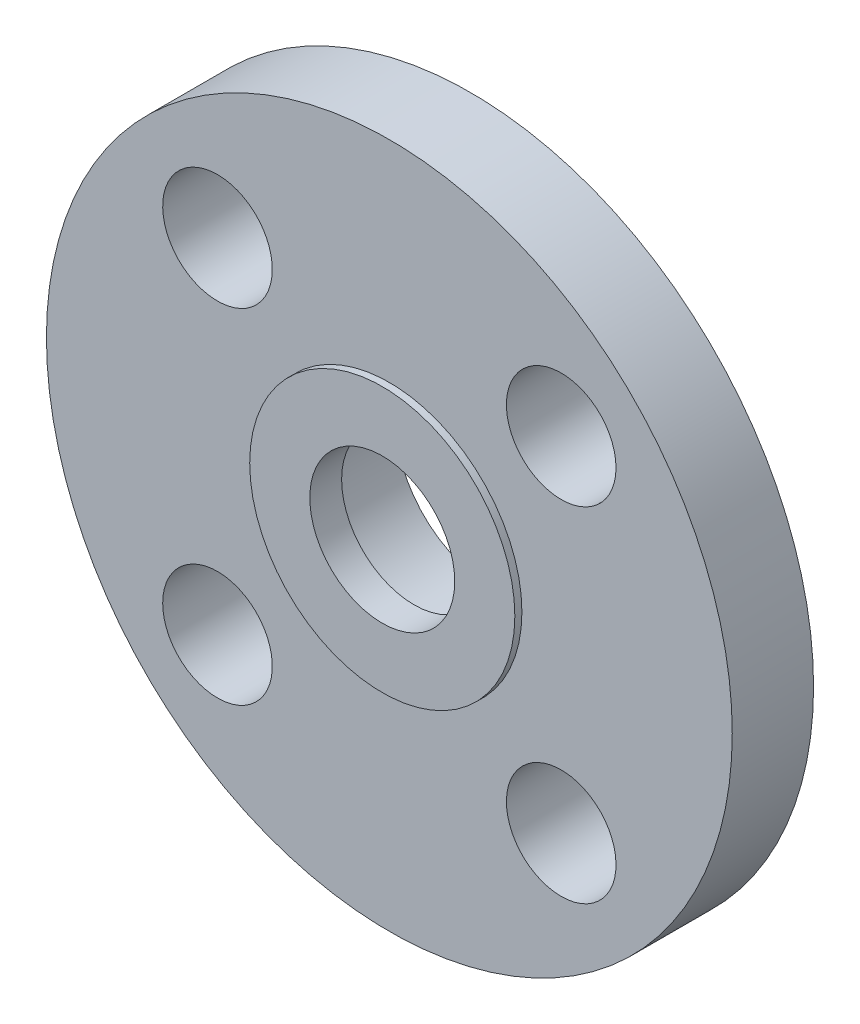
ISO-10303-21;
HEADER;
FILE_DESCRIPTION(('STEP AP214'),'2;1');
FILE_NAME('part.step','',(''),(''),'','','');
FILE_SCHEMA(('AUTOMOTIVE_DESIGN { 1 0 10303 214 1 1 1 1 }'));
ENDSEC;
DATA;
#1=APPLICATION_CONTEXT('core data for automotive mechanical design processes');
#2=APPLICATION_PROTOCOL_DEFINITION('international standard','automotive_design',2000,#1);
#3=PRODUCT_CONTEXT('',#1,'mechanical');
#4=PRODUCT('Part','Part','',(#3));
#5=PRODUCT_RELATED_PRODUCT_CATEGORY('part','',(#4));
#6=PRODUCT_DEFINITION_FORMATION('','',#4);
#7=PRODUCT_DEFINITION_CONTEXT('part definition',#1,'design');
#8=PRODUCT_DEFINITION('design','',#6,#7);
#9=PRODUCT_DEFINITION_SHAPE('','',#8);
#10=(LENGTH_UNIT() NAMED_UNIT(*) SI_UNIT(.MILLI.,.METRE.));
#11=(NAMED_UNIT(*) PLANE_ANGLE_UNIT() SI_UNIT($,.RADIAN.));
#12=(NAMED_UNIT(*) SI_UNIT($,.STERADIAN.) SOLID_ANGLE_UNIT());
#13=UNCERTAINTY_MEASURE_WITH_UNIT(LENGTH_MEASURE(1.E-05),#10,'distance_accuracy_value','');
#14=(GEOMETRIC_REPRESENTATION_CONTEXT(3) GLOBAL_UNCERTAINTY_ASSIGNED_CONTEXT((#13)) GLOBAL_UNIT_ASSIGNED_CONTEXT((#10,
#11,#12)) REPRESENTATION_CONTEXT('',''));
#15=CARTESIAN_POINT('',(0.,0.,0.));
#16=DIRECTION('',(0.,0.,1.));
#17=DIRECTION('',(1.,0.,0.));
#18=AXIS2_PLACEMENT_3D('',#15,#16,#17);
#19=CARTESIAN_POINT('',(0.,0.,-15.748));
#20=DIRECTION('',(0.,0.,1.));
#21=DIRECTION('',(1.,0.,0.));
#22=AXIS2_PLACEMENT_3D('',#19,#20,#21);
#23=CYLINDRICAL_SURFACE('',#22,10.414);
#24=CARTESIAN_POINT('',(0.,0.,0.));
#25=DIRECTION('',(0.,0.,1.));
#26=DIRECTION('',(1.,0.,0.));
#27=AXIS2_PLACEMENT_3D('',#24,#25,#26);
#28=CIRCLE('',#27,10.414);
#29=CARTESIAN_POINT('',(10.414,0.,0.));
#30=VERTEX_POINT('',#29);
#31=EDGE_CURVE('E148',#30,#30,#28,.T.);
#32=ORIENTED_EDGE('',*,*,#31,.T.);
#33=EDGE_LOOP('',(#32));
#34=FACE_BOUND('',#33,.T.);
#35=CARTESIAN_POINT('',(0.,0.,-4.572));
#36=DIRECTION('',(0.,0.,-1.));
#37=DIRECTION('',(-1.,0.,0.));
#38=AXIS2_PLACEMENT_3D('',#35,#36,#37);
#39=CIRCLE('',#38,10.414);
#40=CARTESIAN_POINT('',(-10.414,0.,-4.572));
#41=VERTEX_POINT('',#40);
#42=EDGE_CURVE('E35',#41,#41,#39,.F.);
#43=ORIENTED_EDGE('',*,*,#42,.F.);
#44=EDGE_LOOP('',(#43));
#45=FACE_BOUND('',#44,.T.);
#46=ADVANCED_FACE('F31',(#34,#45),#23,.F.);
#47=CARTESIAN_POINT('',(0.,0.,-15.748));
#48=DIRECTION('',(0.,0.,1.));
#49=DIRECTION('',(1.,0.,0.));
#50=AXIS2_PLACEMENT_3D('',#47,#48,#49);
#51=CYLINDRICAL_SURFACE('',#50,19.05);
#52=CARTESIAN_POINT('',(0.,0.,-1.016));
#53=DIRECTION('',(0.,0.,1.));
#54=DIRECTION('',(1.,0.,0.));
#55=AXIS2_PLACEMENT_3D('',#52,#53,#54);
#56=CIRCLE('',#55,19.05);
#57=CARTESIAN_POINT('',(19.05,0.,-1.016));
#58=VERTEX_POINT('',#57);
#59=EDGE_CURVE('E10',#58,#58,#56,.F.);
#60=ORIENTED_EDGE('',*,*,#59,.F.);
#61=EDGE_LOOP('',(#60));
#62=FACE_BOUND('',#61,.T.);
#63=CARTESIAN_POINT('',(0.,0.,0.));
#64=DIRECTION('',(0.,0.,1.));
#65=DIRECTION('',(1.,0.,0.));
#66=AXIS2_PLACEMENT_3D('',#63,#64,#65);
#67=CIRCLE('',#66,19.05);
#68=CARTESIAN_POINT('',(19.05,0.,0.));
#69=VERTEX_POINT('',#68);
#70=EDGE_CURVE('E44',#69,#69,#67,.T.);
#71=ORIENTED_EDGE('',*,*,#70,.F.);
#72=EDGE_LOOP('',(#71));
#73=FACE_BOUND('',#72,.T.);
#74=ADVANCED_FACE('F33',(#62,#73),#51,.T.);
#75=CARTESIAN_POINT('',(0.,0.,0.));
#76=DIRECTION('',(0.,0.,1.));
#77=DIRECTION('',(1.,0.,0.));
#78=AXIS2_PLACEMENT_3D('',#75,#76,#77);
#79=PLANE('',#78);
#80=ORIENTED_EDGE('',*,*,#31,.F.);
#81=EDGE_LOOP('',(#80));
#82=FACE_BOUND('',#81,.T.);
#83=ORIENTED_EDGE('',*,*,#70,.T.);
#84=EDGE_LOOP('',(#83));
#85=FACE_BOUND('',#84,.T.);
#86=ADVANCED_FACE('F89',(#82,#85),#79,.T.);
#87=CARTESIAN_POINT('',(0.,0.,-152.073574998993));
#88=DIRECTION('',(0.,0.,1.));
#89=DIRECTION('',(1.,0.,0.));
#90=AXIS2_PLACEMENT_3D('',#87,#88,#89);
#91=CYLINDRICAL_SURFACE('',#90,49.276);
#92=CARTESIAN_POINT('',(0.,0.,-12.7));
#93=DIRECTION('',(0.,0.,1.));
#94=DIRECTION('',(1.,0.,0.));
#95=AXIS2_PLACEMENT_3D('',#92,#93,#94);
#96=CIRCLE('',#95,49.276);
#97=CARTESIAN_POINT('',(49.276,0.,-12.7));
#98=VERTEX_POINT('',#97);
#99=EDGE_CURVE('E56',#98,#98,#96,.F.);
#100=ORIENTED_EDGE('',*,*,#99,.F.);
#101=EDGE_LOOP('',(#100));
#102=FACE_BOUND('',#101,.T.);
#103=CARTESIAN_POINT('',(0.,0.,-1.016));
#104=DIRECTION('',(0.,0.,1.));
#105=DIRECTION('',(1.,0.,0.));
#106=AXIS2_PLACEMENT_3D('',#103,#104,#105);
#107=CIRCLE('',#106,49.276);
#108=CARTESIAN_POINT('',(49.276,0.,-1.016));
#109=VERTEX_POINT('',#108);
#110=EDGE_CURVE('E51',#109,#109,#107,.T.);
#111=ORIENTED_EDGE('',*,*,#110,.F.);
#112=EDGE_LOOP('',(#111));
#113=FACE_BOUND('',#112,.T.);
#114=ADVANCED_FACE('F86',(#102,#113),#91,.T.);
#115=CARTESIAN_POINT('',(0.,0.,-1.016));
#116=DIRECTION('',(0.,0.,1.));
#117=DIRECTION('',(1.,0.,0.));
#118=AXIS2_PLACEMENT_3D('',#115,#116,#117);
#119=PLANE('',#118);
#120=CARTESIAN_POINT('',(24.6957043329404,-24.6957043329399,-1.016));
#121=DIRECTION('',(0.,0.,1.));
#122=DIRECTION('',(0.,-1.,0.));
#123=AXIS2_PLACEMENT_3D('',#120,#121,#122);
#124=CIRCLE('',#123,7.874);
#125=CARTESIAN_POINT('',(24.6957043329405,-32.5697043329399,-1.016));
#126=VERTEX_POINT('',#125);
#127=EDGE_CURVE('E149',#126,#126,#124,.T.);
#128=ORIENTED_EDGE('',*,*,#127,.F.);
#129=EDGE_LOOP('',(#128));
#130=FACE_BOUND('',#129,.T.);
#131=CARTESIAN_POINT('',(-24.69570433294,-24.6957043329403,-1.016));
#132=DIRECTION('',(0.,0.,1.));
#133=DIRECTION('',(-1.,0.,0.));
#134=AXIS2_PLACEMENT_3D('',#131,#132,#133);
#135=CIRCLE('',#134,7.874);
#136=CARTESIAN_POINT('',(-32.56970433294,-24.6957043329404,-1.016));
#137=VERTEX_POINT('',#136);
#138=EDGE_CURVE('E162',#137,#137,#135,.T.);
#139=ORIENTED_EDGE('',*,*,#138,.F.);
#140=EDGE_LOOP('',(#139));
#141=FACE_BOUND('',#140,.T.);
#142=CARTESIAN_POINT('',(-24.6957043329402,24.6957043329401,-1.016));
#143=DIRECTION('',(0.,0.,1.));
#144=DIRECTION('',(0.,1.,0.));
#145=AXIS2_PLACEMENT_3D('',#142,#143,#144);
#146=CIRCLE('',#145,7.874);
#147=CARTESIAN_POINT('',(-24.6957043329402,32.5697043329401,-1.016));
#148=VERTEX_POINT('',#147);
#149=EDGE_CURVE('E64',#148,#148,#146,.T.);
#150=ORIENTED_EDGE('',*,*,#149,.F.);
#151=EDGE_LOOP('',(#150));
#152=FACE_BOUND('',#151,.T.);
#153=CARTESIAN_POINT('',(24.6957043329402,24.6957043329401,-1.016));
#154=DIRECTION('',(0.,0.,1.));
#155=DIRECTION('',(1.,0.,0.));
#156=AXIS2_PLACEMENT_3D('',#153,#154,#155);
#157=CIRCLE('',#156,7.874);
#158=CARTESIAN_POINT('',(32.5697043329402,24.6957043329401,-1.016));
#159=VERTEX_POINT('',#158);
#160=EDGE_CURVE('E52',#159,#159,#157,.T.);
#161=ORIENTED_EDGE('',*,*,#160,.F.);
#162=EDGE_LOOP('',(#161));
#163=FACE_BOUND('',#162,.T.);
#164=ORIENTED_EDGE('',*,*,#59,.T.);
#165=EDGE_LOOP('',(#164));
#166=FACE_BOUND('',#165,.T.);
#167=ORIENTED_EDGE('',*,*,#110,.T.);
#168=EDGE_LOOP('',(#167));
#169=FACE_BOUND('',#168,.T.);
#170=ADVANCED_FACE('F81',(#130,#141,#152,#163,#166,#169),#119,.T.);
#171=CARTESIAN_POINT('',(0.,0.,-12.7));
#172=DIRECTION('',(0.,0.,1.));
#173=DIRECTION('',(1.,0.,0.));
#174=AXIS2_PLACEMENT_3D('',#171,#172,#173);
#175=PLANE('',#174);
#176=CARTESIAN_POINT('',(24.6957043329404,-24.6957043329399,-12.7));
#177=DIRECTION('',(0.,0.,1.));
#178=DIRECTION('',(0.,-1.,0.));
#179=AXIS2_PLACEMENT_3D('',#176,#177,#178);
#180=CIRCLE('',#179,7.874);
#181=CARTESIAN_POINT('',(24.6957043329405,-32.5697043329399,-12.7));
#182=VERTEX_POINT('',#181);
#183=EDGE_CURVE('E152',#182,#182,#180,.T.);
#184=ORIENTED_EDGE('',*,*,#183,.T.);
#185=EDGE_LOOP('',(#184));
#186=FACE_BOUND('',#185,.T.);
#187=CARTESIAN_POINT('',(-24.69570433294,-24.6957043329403,-12.7));
#188=DIRECTION('',(0.,0.,1.));
#189=DIRECTION('',(-1.,0.,0.));
#190=AXIS2_PLACEMENT_3D('',#187,#188,#189);
#191=CIRCLE('',#190,7.874);
#192=CARTESIAN_POINT('',(-32.56970433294,-24.6957043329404,-12.7));
#193=VERTEX_POINT('',#192);
#194=EDGE_CURVE('E165',#193,#193,#191,.T.);
#195=ORIENTED_EDGE('',*,*,#194,.T.);
#196=EDGE_LOOP('',(#195));
#197=FACE_BOUND('',#196,.T.);
#198=CARTESIAN_POINT('',(-24.6957043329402,24.6957043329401,-12.7));
#199=DIRECTION('',(0.,0.,1.));
#200=DIRECTION('',(0.,1.,0.));
#201=AXIS2_PLACEMENT_3D('',#198,#199,#200);
#202=CIRCLE('',#201,7.874);
#203=CARTESIAN_POINT('',(-24.6957043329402,32.5697043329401,-12.7));
#204=VERTEX_POINT('',#203);
#205=EDGE_CURVE('E59',#204,#204,#202,.T.);
#206=ORIENTED_EDGE('',*,*,#205,.T.);
#207=EDGE_LOOP('',(#206));
#208=FACE_BOUND('',#207,.T.);
#209=CARTESIAN_POINT('',(24.6957043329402,24.6957043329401,-12.7));
#210=DIRECTION('',(0.,0.,1.));
#211=DIRECTION('',(1.,0.,0.));
#212=AXIS2_PLACEMENT_3D('',#209,#210,#211);
#213=CIRCLE('',#212,7.874);
#214=CARTESIAN_POINT('',(32.5697043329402,24.6957043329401,-12.7));
#215=VERTEX_POINT('',#214);
#216=EDGE_CURVE('E49',#215,#215,#213,.T.);
#217=ORIENTED_EDGE('',*,*,#216,.T.);
#218=EDGE_LOOP('',(#217));
#219=FACE_BOUND('',#218,.T.);
#220=CARTESIAN_POINT('',(0.,0.,-12.7));
#221=DIRECTION('',(0.,0.,1.));
#222=DIRECTION('',(1.,0.,0.));
#223=AXIS2_PLACEMENT_3D('',#220,#221,#222);
#224=CIRCLE('',#223,19.05);
#225=CARTESIAN_POINT('',(19.05,0.,-12.7));
#226=VERTEX_POINT('',#225);
#227=EDGE_CURVE('E47',#226,#226,#224,.F.);
#228=ORIENTED_EDGE('',*,*,#227,.F.);
#229=EDGE_LOOP('',(#228));
#230=FACE_BOUND('',#229,.T.);
#231=ORIENTED_EDGE('',*,*,#99,.T.);
#232=EDGE_LOOP('',(#231));
#233=FACE_BOUND('',#232,.T.);
#234=ADVANCED_FACE('F77',(#186,#197,#208,#219,#230,#233),#175,.F.);
#235=CARTESIAN_POINT('',(0.,0.,-15.748));
#236=DIRECTION('',(0.,0.,1.));
#237=DIRECTION('',(1.,0.,0.));
#238=AXIS2_PLACEMENT_3D('',#235,#236,#237);
#239=PLANE('',#238);
#240=CARTESIAN_POINT('',(0.,0.,-15.748));
#241=DIRECTION('',(0.,0.,-1.));
#242=DIRECTION('',(-1.,0.,0.));
#243=AXIS2_PLACEMENT_3D('',#240,#241,#242);
#244=CIRCLE('',#243,13.843);
#245=CARTESIAN_POINT('',(-13.843,0.,-15.748));
#246=VERTEX_POINT('',#245);
#247=EDGE_CURVE('E157',#246,#246,#244,.T.);
#248=ORIENTED_EDGE('',*,*,#247,.F.);
#249=EDGE_LOOP('',(#248));
#250=FACE_BOUND('',#249,.T.);
#251=CARTESIAN_POINT('',(0.,0.,-15.748));
#252=DIRECTION('',(0.,0.,1.));
#253=DIRECTION('',(1.,0.,0.));
#254=AXIS2_PLACEMENT_3D('',#251,#252,#253);
#255=CIRCLE('',#254,19.05);
#256=CARTESIAN_POINT('',(19.05,0.,-15.748));
#257=VERTEX_POINT('',#256);
#258=EDGE_CURVE('E39',#257,#257,#255,.T.);
#259=ORIENTED_EDGE('',*,*,#258,.F.);
#260=EDGE_LOOP('',(#259));
#261=FACE_BOUND('',#260,.T.);
#262=ADVANCED_FACE('F80',(#250,#261),#239,.F.);
#263=ORIENTED_EDGE('',*,*,#258,.T.);
#264=EDGE_LOOP('',(#263));
#265=FACE_BOUND('',#264,.T.);
#266=ORIENTED_EDGE('',*,*,#227,.T.);
#267=EDGE_LOOP('',(#266));
#268=FACE_BOUND('',#267,.T.);
#269=ADVANCED_FACE('F75',(#265,#268),#51,.T.);
#270=CARTESIAN_POINT('',(24.6957043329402,24.6957043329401,-15.748));
#271=DIRECTION('',(0.,0.,1.));
#272=DIRECTION('',(1.,0.,0.));
#273=AXIS2_PLACEMENT_3D('',#270,#271,#272);
#274=CYLINDRICAL_SURFACE('',#273,7.874);
#275=ORIENTED_EDGE('',*,*,#160,.T.);
#276=EDGE_LOOP('',(#275));
#277=FACE_BOUND('',#276,.T.);
#278=ORIENTED_EDGE('',*,*,#216,.F.);
#279=EDGE_LOOP('',(#278));
#280=FACE_BOUND('',#279,.T.);
#281=ADVANCED_FACE('F125',(#277,#280),#274,.F.);
#282=CARTESIAN_POINT('',(-24.6957043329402,24.6957043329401,-15.748));
#283=DIRECTION('',(0.,0.,1.));
#284=DIRECTION('',(0.,1.,0.));
#285=AXIS2_PLACEMENT_3D('',#282,#283,#284);
#286=CYLINDRICAL_SURFACE('',#285,7.874);
#287=ORIENTED_EDGE('',*,*,#149,.T.);
#288=EDGE_LOOP('',(#287));
#289=FACE_BOUND('',#288,.T.);
#290=ORIENTED_EDGE('',*,*,#205,.F.);
#291=EDGE_LOOP('',(#290));
#292=FACE_BOUND('',#291,.T.);
#293=ADVANCED_FACE('F121',(#289,#292),#286,.F.);
#294=CARTESIAN_POINT('',(-24.69570433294,-24.6957043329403,-15.748));
#295=DIRECTION('',(0.,0.,1.));
#296=DIRECTION('',(-1.,0.,0.));
#297=AXIS2_PLACEMENT_3D('',#294,#295,#296);
#298=CYLINDRICAL_SURFACE('',#297,7.874);
#299=ORIENTED_EDGE('',*,*,#138,.T.);
#300=EDGE_LOOP('',(#299));
#301=FACE_BOUND('',#300,.T.);
#302=ORIENTED_EDGE('',*,*,#194,.F.);
#303=EDGE_LOOP('',(#302));
#304=FACE_BOUND('',#303,.T.);
#305=ADVANCED_FACE('F117',(#301,#304),#298,.F.);
#306=CARTESIAN_POINT('',(24.6957043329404,-24.6957043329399,-15.748));
#307=DIRECTION('',(0.,0.,1.));
#308=DIRECTION('',(0.,-1.,0.));
#309=AXIS2_PLACEMENT_3D('',#306,#307,#308);
#310=CYLINDRICAL_SURFACE('',#309,7.874);
#311=ORIENTED_EDGE('',*,*,#127,.T.);
#312=EDGE_LOOP('',(#311));
#313=FACE_BOUND('',#312,.T.);
#314=ORIENTED_EDGE('',*,*,#183,.F.);
#315=EDGE_LOOP('',(#314));
#316=FACE_BOUND('',#315,.T.);
#317=ADVANCED_FACE('F113',(#313,#316),#310,.F.);
#318=CARTESIAN_POINT('',(0.,0.,-4.572));
#319=DIRECTION('',(0.,0.,-1.));
#320=DIRECTION('',(-1.,0.,0.));
#321=AXIS2_PLACEMENT_3D('',#318,#319,#320);
#322=PLANE('',#321);
#323=CARTESIAN_POINT('',(0.,0.,-4.572));
#324=DIRECTION('',(0.,0.,-1.));
#325=DIRECTION('',(-1.,0.,0.));
#326=AXIS2_PLACEMENT_3D('',#323,#324,#325);
#327=CIRCLE('',#326,13.843);
#328=CARTESIAN_POINT('',(-13.843,0.,-4.572));
#329=VERTEX_POINT('',#328);
#330=EDGE_CURVE('E155',#329,#329,#327,.T.);
#331=ORIENTED_EDGE('',*,*,#330,.T.);
#332=EDGE_LOOP('',(#331));
#333=FACE_BOUND('',#332,.T.);
#334=ORIENTED_EDGE('',*,*,#42,.T.);
#335=EDGE_LOOP('',(#334));
#336=FACE_BOUND('',#335,.T.);
#337=ADVANCED_FACE('F116',(#333,#336),#322,.T.);
#338=CARTESIAN_POINT('',(0.,0.,-4.572));
#339=DIRECTION('',(0.,0.,-1.));
#340=DIRECTION('',(-1.,0.,0.));
#341=AXIS2_PLACEMENT_3D('',#338,#339,#340);
#342=CYLINDRICAL_SURFACE('',#341,13.843);
#343=ORIENTED_EDGE('',*,*,#330,.F.);
#344=EDGE_LOOP('',(#343));
#345=FACE_BOUND('',#344,.T.);
#346=ORIENTED_EDGE('',*,*,#247,.T.);
#347=EDGE_LOOP('',(#346));
#348=FACE_BOUND('',#347,.T.);
#349=ADVANCED_FACE('F111',(#345,#348),#342,.F.);
#350=CLOSED_SHELL('',(#46,#74,#86,#114,#170,#234,#262,#269,#281,#293,#305,#317,#337,#349));
#351=MANIFOLD_SOLID_BREP('B2',#350);
#352=ADVANCED_BREP_SHAPE_REPRESENTATION('',(#18,#351),#14);
#353=SHAPE_DEFINITION_REPRESENTATION(#9,#352);
ENDSEC;
END-ISO-10303-21;
